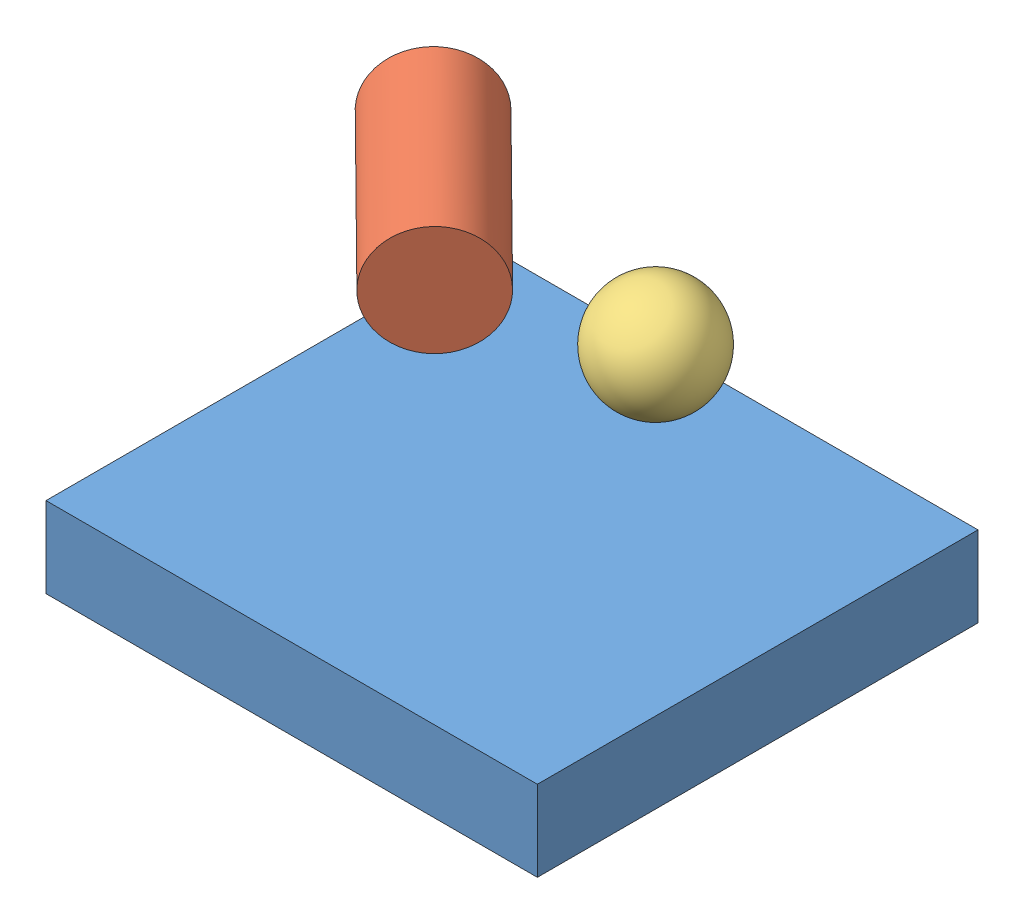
SolidWorks assembly Tangent.SLDASM, configuration Default (file format 3400). Lengths in mm.
Overall size (226.59 164.17 203.2).
3 component instances, 3 part files, 0 mates.
Components (placement in the parent):
- Simple Plate-1: Simple Plate.SLDPRT [Default] at origin size (226.59 37.18 203.2)
- Cylinder-1: Cylinder.SLDPRT [Default] at (25.3735 129.2143 50.0931) x (-0.369464 0.850926 0.373391) z (0.710835 0 0.703359) size (50.8 50.8 101.6)
- Sphere-1: Sphere.SLDPRT [Default] at (171.2322 130.1559 93.3306) x (0.432294 -0.142624 -0.890382) z (0.896986 0.169199 0.408397) size (50.8 50.8 50.8)
